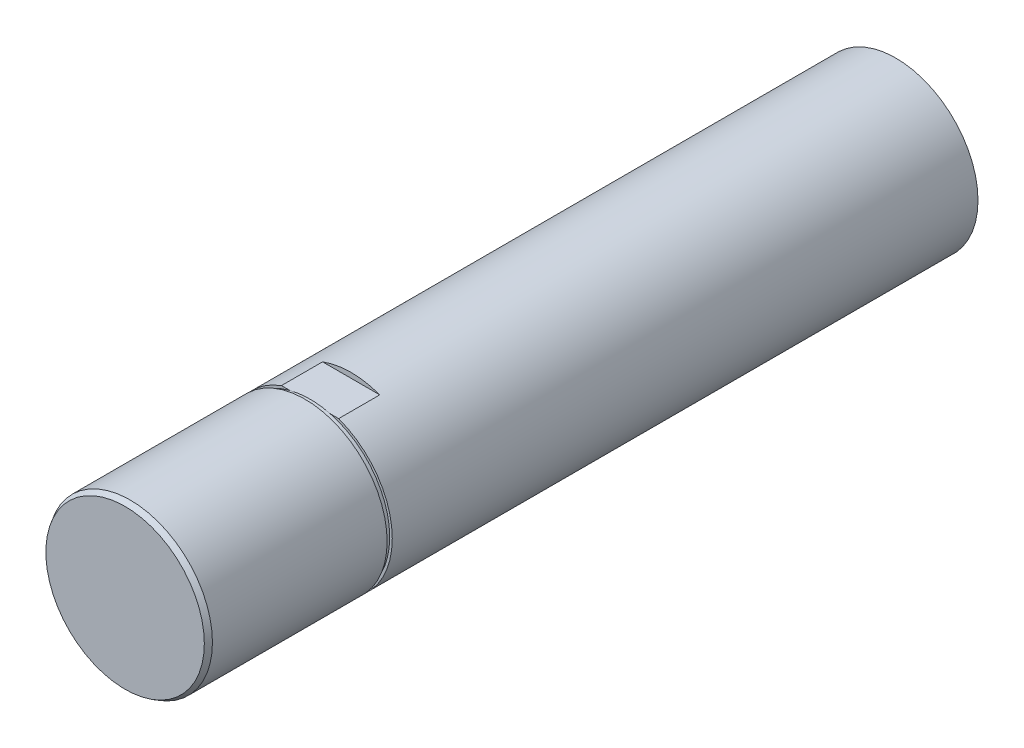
ISO-10303-21;
HEADER;
FILE_DESCRIPTION(('STEP AP214'),'2;1');
FILE_NAME('part.step','',(''),(''),'','','');
FILE_SCHEMA(('AUTOMOTIVE_DESIGN { 1 0 10303 214 1 1 1 1 }'));
ENDSEC;
DATA;
#1=APPLICATION_CONTEXT('core data for automotive mechanical design processes');
#2=APPLICATION_PROTOCOL_DEFINITION('international standard','automotive_design',2000,#1);
#3=PRODUCT_CONTEXT('',#1,'mechanical');
#4=PRODUCT('Part','Part','',(#3));
#5=PRODUCT_RELATED_PRODUCT_CATEGORY('part','',(#4));
#6=PRODUCT_DEFINITION_FORMATION('','',#4);
#7=PRODUCT_DEFINITION_CONTEXT('part definition',#1,'design');
#8=PRODUCT_DEFINITION('design','',#6,#7);
#9=PRODUCT_DEFINITION_SHAPE('','',#8);
#10=(LENGTH_UNIT() NAMED_UNIT(*) SI_UNIT(.MILLI.,.METRE.));
#11=(NAMED_UNIT(*) PLANE_ANGLE_UNIT() SI_UNIT($,.RADIAN.));
#12=(NAMED_UNIT(*) SI_UNIT($,.STERADIAN.) SOLID_ANGLE_UNIT());
#13=UNCERTAINTY_MEASURE_WITH_UNIT(LENGTH_MEASURE(1.E-05),#10,'distance_accuracy_value','');
#14=(GEOMETRIC_REPRESENTATION_CONTEXT(3) GLOBAL_UNCERTAINTY_ASSIGNED_CONTEXT((#13)) GLOBAL_UNIT_ASSIGNED_CONTEXT((#10,
#11,#12)) REPRESENTATION_CONTEXT('',''));
#15=CARTESIAN_POINT('',(0.,0.,0.));
#16=DIRECTION('',(0.,0.,1.));
#17=DIRECTION('',(1.,0.,0.));
#18=AXIS2_PLACEMENT_3D('',#15,#16,#17);
#19=CARTESIAN_POINT('',(0.,0.,14.));
#20=DIRECTION('',(0.,0.,1.));
#21=DIRECTION('',(1.,0.,0.));
#22=AXIS2_PLACEMENT_3D('',#19,#20,#21);
#23=PLANE('',#22);
#24=DIRECTION('',(1.,0.,0.));
#25=VECTOR('',#24,1.);
#26=CARTESIAN_POINT('',(-10.5,-15.,14.));
#27=LINE('',#26,#25);
#28=CARTESIAN_POINT('',(3.90512483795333,-15.,14.));
#29=VERTEX_POINT('',#28);
#30=CARTESIAN_POINT('',(5.56776436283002,-15.,14.));
#31=VERTEX_POINT('',#30);
#32=EDGE_CURVE('E102',#29,#31,#27,.T.);
#33=ORIENTED_EDGE('',*,*,#32,.T.);
#34=CARTESIAN_POINT('',(0.,0.,14.));
#35=DIRECTION('',(0.,0.,1.));
#36=DIRECTION('',(1.,0.,0.));
#37=AXIS2_PLACEMENT_3D('',#34,#35,#36);
#38=CIRCLE('',#37,16.);
#39=CARTESIAN_POINT('',(5.56776436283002,15.,14.));
#40=VERTEX_POINT('',#39);
#41=EDGE_CURVE('E116',#31,#40,#38,.T.);
#42=ORIENTED_EDGE('',*,*,#41,.T.);
#43=DIRECTION('',(1.,0.,0.));
#44=VECTOR('',#43,1.);
#45=CARTESIAN_POINT('',(-10.5,15.,14.));
#46=LINE('',#45,#44);
#47=CARTESIAN_POINT('',(3.90512483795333,15.,14.));
#48=VERTEX_POINT('',#47);
#49=EDGE_CURVE('E150',#48,#40,#46,.T.);
#50=ORIENTED_EDGE('',*,*,#49,.F.);
#51=CARTESIAN_POINT('',(0.,0.,14.));
#52=DIRECTION('',(0.,0.,1.));
#53=DIRECTION('',(1.,0.,0.));
#54=AXIS2_PLACEMENT_3D('',#51,#52,#53);
#55=CIRCLE('',#54,15.5);
#56=EDGE_CURVE('E144',#29,#48,#55,.T.);
#57=ORIENTED_EDGE('',*,*,#56,.F.);
#58=EDGE_LOOP('',(#33,#42,#50,#57));
#59=FACE_BOUND('',#58,.T.);
#60=ADVANCED_FACE('F39',(#59),#23,.T.);
#61=CARTESIAN_POINT('',(0.,0.,-100.));
#62=DIRECTION('',(0.,0.,1.));
#63=DIRECTION('',(1.,0.,0.));
#64=AXIS2_PLACEMENT_3D('',#61,#62,#63);
#65=CYLINDRICAL_SURFACE('',#64,16.);
#66=CARTESIAN_POINT('',(0.,0.,15.));
#67=DIRECTION('',(0.,0.,1.));
#68=DIRECTION('',(1.,0.,0.));
#69=AXIS2_PLACEMENT_3D('',#66,#67,#68);
#70=CIRCLE('',#69,16.);
#71=CARTESIAN_POINT('',(16.,0.,15.));
#72=VERTEX_POINT('',#71);
#73=EDGE_CURVE('E115',#72,#72,#70,.T.);
#74=ORIENTED_EDGE('',*,*,#73,.T.);
#75=EDGE_LOOP('',(#74));
#76=FACE_BOUND('',#75,.T.);
#77=CARTESIAN_POINT('',(0.,0.,49.));
#78=DIRECTION('',(0.,0.,1.));
#79=DIRECTION('',(1.,0.,0.));
#80=AXIS2_PLACEMENT_3D('',#77,#78,#79);
#81=CIRCLE('',#80,16.);
#82=CARTESIAN_POINT('',(16.,0.,49.));
#83=VERTEX_POINT('',#82);
#84=EDGE_CURVE('E129',#83,#83,#81,.F.);
#85=ORIENTED_EDGE('',*,*,#84,.T.);
#86=EDGE_LOOP('',(#85));
#87=FACE_BOUND('',#86,.T.);
#88=ADVANCED_FACE('F180',(#76,#87),#65,.T.);
#89=CARTESIAN_POINT('',(0.,0.,50.));
#90=DIRECTION('',(0.,0.,1.));
#91=DIRECTION('',(1.,0.,0.));
#92=AXIS2_PLACEMENT_3D('',#89,#90,#91);
#93=PLANE('',#92);
#94=CARTESIAN_POINT('',(0.,0.,50.));
#95=DIRECTION('',(0.,0.,1.));
#96=DIRECTION('',(1.,0.,0.));
#97=AXIS2_PLACEMENT_3D('',#94,#95,#96);
#98=CIRCLE('',#97,15.4226497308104);
#99=CARTESIAN_POINT('',(15.4226497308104,0.,50.));
#100=VERTEX_POINT('',#99);
#101=EDGE_CURVE('E126',#100,#100,#98,.T.);
#102=ORIENTED_EDGE('',*,*,#101,.T.);
#103=EDGE_LOOP('',(#102));
#104=FACE_BOUND('',#103,.T.);
#105=ADVANCED_FACE('F185',(#104),#93,.T.);
#106=CARTESIAN_POINT('',(0.,0.,50.));
#107=DIRECTION('',(0.,0.,-1.));
#108=DIRECTION('',(-1.,0.,0.));
#109=AXIS2_PLACEMENT_3D('',#106,#107,#108);
#110=CONICAL_SURFACE('',#109,15.4226497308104,0.523598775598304);
#111=ORIENTED_EDGE('',*,*,#84,.F.);
#112=EDGE_LOOP('',(#111));
#113=FACE_BOUND('',#112,.T.);
#114=ORIENTED_EDGE('',*,*,#101,.F.);
#115=EDGE_LOOP('',(#114));
#116=FACE_BOUND('',#115,.T.);
#117=ADVANCED_FACE('F41',(#113,#116),#110,.T.);
#118=CARTESIAN_POINT('',(0.,0.,15.));
#119=DIRECTION('',(0.,0.,1.));
#120=DIRECTION('',(1.,0.,0.));
#121=AXIS2_PLACEMENT_3D('',#118,#119,#120);
#122=PLANE('',#121);
#123=ORIENTED_EDGE('',*,*,#73,.F.);
#124=EDGE_LOOP('',(#123));
#125=FACE_BOUND('',#124,.T.);
#126=CARTESIAN_POINT('',(0.,0.,15.));
#127=DIRECTION('',(0.,0.,1.));
#128=DIRECTION('',(1.,0.,0.));
#129=AXIS2_PLACEMENT_3D('',#126,#127,#128);
#130=CIRCLE('',#129,15.5);
#131=CARTESIAN_POINT('',(15.5,0.,15.));
#132=VERTEX_POINT('',#131);
#133=EDGE_CURVE('E121',#132,#132,#130,.T.);
#134=ORIENTED_EDGE('',*,*,#133,.T.);
#135=EDGE_LOOP('',(#134));
#136=FACE_BOUND('',#135,.T.);
#137=ADVANCED_FACE('F190',(#125,#136),#122,.F.);
#138=CARTESIAN_POINT('',(-5.56776436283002,-15.,14.));
#139=VERTEX_POINT('',#138);
#140=CARTESIAN_POINT('',(-3.90512483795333,-15.,14.));
#141=VERTEX_POINT('',#140);
#142=EDGE_CURVE('E91',#139,#141,#27,.T.);
#143=ORIENTED_EDGE('',*,*,#142,.T.);
#144=CARTESIAN_POINT('',(-3.90512483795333,15.,14.));
#145=VERTEX_POINT('',#144);
#146=EDGE_CURVE('E154',#145,#141,#55,.T.);
#147=ORIENTED_EDGE('',*,*,#146,.F.);
#148=CARTESIAN_POINT('',(-5.56776436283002,15.,14.));
#149=VERTEX_POINT('',#148);
#150=EDGE_CURVE('E114',#149,#145,#46,.T.);
#151=ORIENTED_EDGE('',*,*,#150,.F.);
#152=EDGE_CURVE('E108',#149,#139,#38,.T.);
#153=ORIENTED_EDGE('',*,*,#152,.T.);
#154=EDGE_LOOP('',(#143,#147,#151,#153));
#155=FACE_BOUND('',#154,.T.);
#156=ADVANCED_FACE('F112',(#155),#23,.T.);
#157=CARTESIAN_POINT('',(0.,0.,15.));
#158=DIRECTION('',(0.,0.,-1.));
#159=DIRECTION('',(-1.,0.,0.));
#160=AXIS2_PLACEMENT_3D('',#157,#158,#159);
#161=CYLINDRICAL_SURFACE('',#160,15.5);
#162=ORIENTED_EDGE('',*,*,#133,.F.);
#163=EDGE_LOOP('',(#162));
#164=FACE_BOUND('',#163,.T.);
#165=EDGE_CURVE('E155',#48,#145,#55,.T.);
#166=ORIENTED_EDGE('',*,*,#165,.T.);
#167=ORIENTED_EDGE('',*,*,#146,.T.);
#168=CARTESIAN_POINT('',(0.,0.,14.));
#169=DIRECTION('',(0.,0.,1.));
#170=DIRECTION('',(1.,0.,0.));
#171=AXIS2_PLACEMENT_3D('',#168,#169,#170);
#172=CIRCLE('',#171,15.5);
#173=EDGE_CURVE('E159',#141,#29,#172,.T.);
#174=ORIENTED_EDGE('',*,*,#173,.T.);
#175=ORIENTED_EDGE('',*,*,#56,.T.);
#176=EDGE_LOOP('',(#166,#167,#174,#175));
#177=FACE_BOUND('',#176,.T.);
#178=ADVANCED_FACE('F165',(#164,#177),#161,.T.);
#179=CARTESIAN_POINT('',(0.,0.,-100.));
#180=DIRECTION('',(0.,0.,1.));
#181=DIRECTION('',(1.,0.,0.));
#182=AXIS2_PLACEMENT_3D('',#179,#180,#181);
#183=PLANE('',#182);
#184=CARTESIAN_POINT('',(0.,0.,-100.));
#185=DIRECTION('',(0.,0.,1.));
#186=DIRECTION('',(1.,0.,0.));
#187=AXIS2_PLACEMENT_3D('',#184,#185,#186);
#188=CIRCLE('',#187,16.);
#189=CARTESIAN_POINT('',(16.,0.,-100.));
#190=VERTEX_POINT('',#189);
#191=EDGE_CURVE('E119',#190,#190,#188,.T.);
#192=ORIENTED_EDGE('',*,*,#191,.F.);
#193=EDGE_LOOP('',(#192));
#194=FACE_BOUND('',#193,.T.);
#195=ADVANCED_FACE('F195',(#194),#183,.F.);
#196=DIRECTION('',(0.,0.,1.));
#197=VECTOR('',#196,1.);
#198=CARTESIAN_POINT('',(-5.56776436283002,-15.,-100.));
#199=LINE('',#198,#197);
#200=CARTESIAN_POINT('',(-5.56776436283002,-15.,6.00000000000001));
#201=VERTEX_POINT('',#200);
#202=EDGE_CURVE('E11',#139,#201,#199,.F.);
#203=ORIENTED_EDGE('',*,*,#202,.F.);
#204=ORIENTED_EDGE('',*,*,#152,.F.);
#205=DIRECTION('',(0.,0.,1.));
#206=VECTOR('',#205,1.);
#207=CARTESIAN_POINT('',(-5.56776436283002,15.,-100.));
#208=LINE('',#207,#206);
#209=CARTESIAN_POINT('',(-5.56776436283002,15.,6.00000000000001));
#210=VERTEX_POINT('',#209);
#211=EDGE_CURVE('E132',#210,#149,#208,.T.);
#212=ORIENTED_EDGE('',*,*,#211,.F.);
#213=CARTESIAN_POINT('',(0.,0.,6.00000000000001));
#214=DIRECTION('',(0.,0.,-1.));
#215=DIRECTION('',(-1.,0.,0.));
#216=AXIS2_PLACEMENT_3D('',#213,#214,#215);
#217=CIRCLE('',#216,16.);
#218=CARTESIAN_POINT('',(5.56776436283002,15.,6.));
#219=VERTEX_POINT('',#218);
#220=EDGE_CURVE('E134',#219,#210,#217,.F.);
#221=ORIENTED_EDGE('',*,*,#220,.F.);
#222=DIRECTION('',(0.,0.,1.));
#223=VECTOR('',#222,1.);
#224=CARTESIAN_POINT('',(5.56776436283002,15.,-100.));
#225=LINE('',#224,#223);
#226=EDGE_CURVE('E136',#40,#219,#225,.F.);
#227=ORIENTED_EDGE('',*,*,#226,.F.);
#228=ORIENTED_EDGE('',*,*,#41,.F.);
#229=DIRECTION('',(0.,0.,1.));
#230=VECTOR('',#229,1.);
#231=CARTESIAN_POINT('',(5.56776436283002,-15.,-100.));
#232=LINE('',#231,#230);
#233=CARTESIAN_POINT('',(5.56776436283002,-15.,6.00000000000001));
#234=VERTEX_POINT('',#233);
#235=EDGE_CURVE('E47',#234,#31,#232,.T.);
#236=ORIENTED_EDGE('',*,*,#235,.F.);
#237=CARTESIAN_POINT('',(0.,0.,6.00000000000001));
#238=DIRECTION('',(0.,0.,-1.));
#239=DIRECTION('',(-1.,0.,0.));
#240=AXIS2_PLACEMENT_3D('',#237,#238,#239);
#241=CIRCLE('',#240,16.);
#242=EDGE_CURVE('E110',#201,#234,#241,.F.);
#243=ORIENTED_EDGE('',*,*,#242,.F.);
#244=EDGE_LOOP('',(#203,#204,#212,#221,#227,#228,#236,#243));
#245=FACE_BOUND('',#244,.T.);
#246=ORIENTED_EDGE('',*,*,#191,.T.);
#247=EDGE_LOOP('',(#246));
#248=FACE_BOUND('',#247,.T.);
#249=ADVANCED_FACE('F105',(#245,#248),#65,.T.);
#250=CARTESIAN_POINT('',(-10.5,16.5,14.));
#251=DIRECTION('',(0.,0.,1.));
#252=DIRECTION('',(1.,0.,0.));
#253=AXIS2_PLACEMENT_3D('',#250,#251,#252);
#254=PLANE('',#253);
#255=EDGE_CURVE('E156',#145,#48,#46,.T.);
#256=ORIENTED_EDGE('',*,*,#255,.F.);
#257=ORIENTED_EDGE('',*,*,#165,.F.);
#258=EDGE_LOOP('',(#256,#257));
#259=FACE_BOUND('',#258,.T.);
#260=ADVANCED_FACE('F206',(#259),#254,.F.);
#261=CARTESIAN_POINT('',(-10.5,16.5,6.));
#262=DIRECTION('',(0.,0.,-1.));
#263=DIRECTION('',(-1.,0.,0.));
#264=AXIS2_PLACEMENT_3D('',#261,#262,#263);
#265=PLANE('',#264);
#266=ORIENTED_EDGE('',*,*,#220,.T.);
#267=DIRECTION('',(1.,0.,0.));
#268=VECTOR('',#267,1.);
#269=CARTESIAN_POINT('',(-10.5,15.,6.));
#270=LINE('',#269,#268);
#271=EDGE_CURVE('E60',#210,#219,#270,.T.);
#272=ORIENTED_EDGE('',*,*,#271,.T.);
#273=EDGE_LOOP('',(#266,#272));
#274=FACE_BOUND('',#273,.T.);
#275=ADVANCED_FACE('F152',(#274),#265,.F.);
#276=CARTESIAN_POINT('',(-10.5,15.,14.));
#277=DIRECTION('',(0.,-1.,0.));
#278=DIRECTION('',(0.,0.,-1.));
#279=AXIS2_PLACEMENT_3D('',#276,#277,#278);
#280=PLANE('',#279);
#281=ORIENTED_EDGE('',*,*,#226,.T.);
#282=ORIENTED_EDGE('',*,*,#271,.F.);
#283=ORIENTED_EDGE('',*,*,#211,.T.);
#284=ORIENTED_EDGE('',*,*,#150,.T.);
#285=ORIENTED_EDGE('',*,*,#255,.T.);
#286=ORIENTED_EDGE('',*,*,#49,.T.);
#287=EDGE_LOOP('',(#281,#282,#283,#284,#285,#286));
#288=FACE_BOUND('',#287,.T.);
#289=ADVANCED_FACE('F148',(#288),#280,.F.);
#290=CARTESIAN_POINT('',(-10.5,-15.,14.));
#291=DIRECTION('',(0.,0.,1.));
#292=DIRECTION('',(1.,0.,0.));
#293=AXIS2_PLACEMENT_3D('',#290,#291,#292);
#294=PLANE('',#293);
#295=EDGE_CURVE('E96',#141,#29,#27,.T.);
#296=ORIENTED_EDGE('',*,*,#295,.T.);
#297=ORIENTED_EDGE('',*,*,#173,.F.);
#298=EDGE_LOOP('',(#296,#297));
#299=FACE_BOUND('',#298,.T.);
#300=ADVANCED_FACE('F168',(#299),#294,.F.);
#301=CARTESIAN_POINT('',(-10.5,-15.,14.));
#302=DIRECTION('',(0.,1.,0.));
#303=DIRECTION('',(0.,0.,1.));
#304=AXIS2_PLACEMENT_3D('',#301,#302,#303);
#305=PLANE('',#304);
#306=ORIENTED_EDGE('',*,*,#202,.T.);
#307=DIRECTION('',(1.,0.,0.));
#308=VECTOR('',#307,1.);
#309=CARTESIAN_POINT('',(-10.5,-15.,6.));
#310=LINE('',#309,#308);
#311=EDGE_CURVE('E53',#201,#234,#310,.T.);
#312=ORIENTED_EDGE('',*,*,#311,.T.);
#313=ORIENTED_EDGE('',*,*,#235,.T.);
#314=ORIENTED_EDGE('',*,*,#32,.F.);
#315=ORIENTED_EDGE('',*,*,#295,.F.);
#316=ORIENTED_EDGE('',*,*,#142,.F.);
#317=EDGE_LOOP('',(#306,#312,#313,#314,#315,#316));
#318=FACE_BOUND('',#317,.T.);
#319=ADVANCED_FACE('F93',(#318),#305,.F.);
#320=CARTESIAN_POINT('',(-10.5,-15.,6.));
#321=DIRECTION('',(0.,0.,-1.));
#322=DIRECTION('',(-1.,0.,0.));
#323=AXIS2_PLACEMENT_3D('',#320,#321,#322);
#324=PLANE('',#323);
#325=ORIENTED_EDGE('',*,*,#242,.T.);
#326=ORIENTED_EDGE('',*,*,#311,.F.);
#327=EDGE_LOOP('',(#325,#326));
#328=FACE_BOUND('',#327,.T.);
#329=ADVANCED_FACE('F175',(#328),#324,.F.);
#330=CLOSED_SHELL('',(#60,#88,#105,#117,#137,#156,#178,#195,#249,#260,#275,#289,#300,#319,#329));
#331=MANIFOLD_SOLID_BREP('B2',#330);
#332=ADVANCED_BREP_SHAPE_REPRESENTATION('',(#18,#331),#14);
#333=SHAPE_DEFINITION_REPRESENTATION(#9,#332);
ENDSEC;
END-ISO-10303-21;
